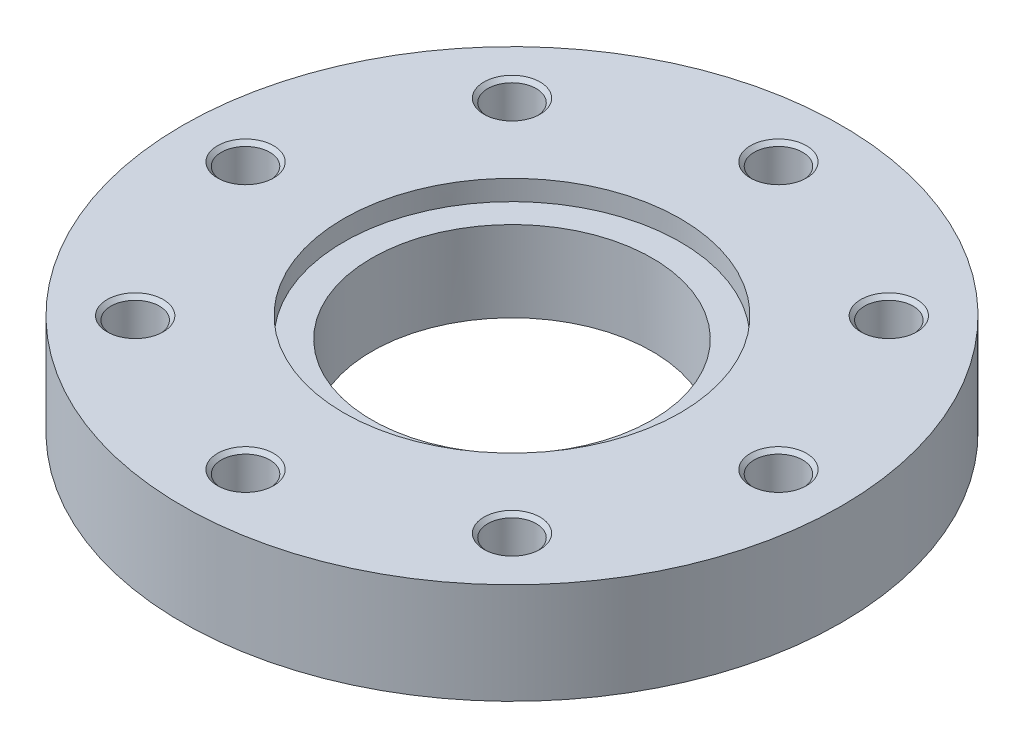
ISO-10303-21;
HEADER;
FILE_DESCRIPTION(('STEP AP214'),'2;1');
FILE_NAME('part.step','',(''),(''),'','','');
FILE_SCHEMA(('AUTOMOTIVE_DESIGN { 1 0 10303 214 1 1 1 1 }'));
ENDSEC;
DATA;
#1=APPLICATION_CONTEXT('core data for automotive mechanical design processes');
#2=APPLICATION_PROTOCOL_DEFINITION('international standard','automotive_design',2000,#1);
#3=PRODUCT_CONTEXT('',#1,'mechanical');
#4=PRODUCT('Part','Part','',(#3));
#5=PRODUCT_RELATED_PRODUCT_CATEGORY('part','',(#4));
#6=PRODUCT_DEFINITION_FORMATION('','',#4);
#7=PRODUCT_DEFINITION_CONTEXT('part definition',#1,'design');
#8=PRODUCT_DEFINITION('design','',#6,#7);
#9=PRODUCT_DEFINITION_SHAPE('','',#8);
#10=(LENGTH_UNIT() NAMED_UNIT(*) SI_UNIT(.MILLI.,.METRE.));
#11=(NAMED_UNIT(*) PLANE_ANGLE_UNIT() SI_UNIT($,.RADIAN.));
#12=(NAMED_UNIT(*) SI_UNIT($,.STERADIAN.) SOLID_ANGLE_UNIT());
#13=UNCERTAINTY_MEASURE_WITH_UNIT(LENGTH_MEASURE(1.E-05),#10,'distance_accuracy_value','');
#14=(GEOMETRIC_REPRESENTATION_CONTEXT(3) GLOBAL_UNCERTAINTY_ASSIGNED_CONTEXT((#13)) GLOBAL_UNIT_ASSIGNED_CONTEXT((#10,
#11,#12)) REPRESENTATION_CONTEXT('',''));
#15=CARTESIAN_POINT('',(0.,0.,0.));
#16=DIRECTION('',(0.,0.,1.));
#17=DIRECTION('',(1.,0.,0.));
#18=AXIS2_PLACEMENT_3D('',#15,#16,#17);
#19=CARTESIAN_POINT('',(0.,18.,0.));
#20=DIRECTION('',(0.,-1.,0.));
#21=DIRECTION('',(1.,0.,0.));
#22=AXIS2_PLACEMENT_3D('',#19,#20,#21);
#23=CYLINDRICAL_SURFACE('',#22,117.5);
#24=CARTESIAN_POINT('',(0.,0.,0.));
#25=DIRECTION('',(0.,1.,0.));
#26=DIRECTION('',(1.,0.,0.));
#27=AXIS2_PLACEMENT_3D('',#24,#25,#26);
#28=CIRCLE('',#27,117.5);
#29=CARTESIAN_POINT('',(117.5,0.,0.));
#30=VERTEX_POINT('',#29);
#31=EDGE_CURVE('E9',#30,#30,#28,.T.);
#32=ORIENTED_EDGE('',*,*,#31,.T.);
#33=EDGE_LOOP('',(#32));
#34=FACE_BOUND('',#33,.T.);
#35=CARTESIAN_POINT('',(0.,36.,0.));
#36=DIRECTION('',(0.,1.,0.));
#37=DIRECTION('',(1.,0.,0.));
#38=AXIS2_PLACEMENT_3D('',#35,#36,#37);
#39=CIRCLE('',#38,117.5);
#40=CARTESIAN_POINT('',(117.5,36.,0.));
#41=VERTEX_POINT('',#40);
#42=EDGE_CURVE('E317',#41,#41,#39,.T.);
#43=ORIENTED_EDGE('',*,*,#42,.F.);
#44=EDGE_LOOP('',(#43));
#45=FACE_BOUND('',#44,.T.);
#46=ADVANCED_FACE('F15',(#34,#45),#23,.T.);
#47=CARTESIAN_POINT('',(83.75,0.,0.));
#48=DIRECTION('',(0.,-1.,0.));
#49=DIRECTION('',(-1.,0.,0.));
#50=AXIS2_PLACEMENT_3D('',#47,#48,#49);
#51=PLANE('',#50);
#52=CARTESIAN_POINT('',(0.,0.,0.));
#53=DIRECTION('',(0.,1.,0.));
#54=DIRECTION('',(1.,0.,0.));
#55=AXIS2_PLACEMENT_3D('',#52,#53,#54);
#56=CIRCLE('',#55,50.);
#57=CARTESIAN_POINT('',(50.,0.,0.));
#58=VERTEX_POINT('',#57);
#59=EDGE_CURVE('E22',#58,#58,#56,.T.);
#60=ORIENTED_EDGE('',*,*,#59,.T.);
#61=EDGE_LOOP('',(#60));
#62=FACE_BOUND('',#61,.T.);
#63=ORIENTED_EDGE('',*,*,#31,.F.);
#64=EDGE_LOOP('',(#63));
#65=FACE_BOUND('',#64,.T.);
#66=ADVANCED_FACE('F323',(#62,#65),#51,.T.);
#67=CARTESIAN_POINT('',(0.,18.,0.));
#68=DIRECTION('',(0.,-1.,0.));
#69=DIRECTION('',(1.,0.,0.));
#70=AXIS2_PLACEMENT_3D('',#67,#68,#69);
#71=CYLINDRICAL_SURFACE('',#70,50.);
#72=ORIENTED_EDGE('',*,*,#59,.F.);
#73=EDGE_LOOP('',(#72));
#74=FACE_BOUND('',#73,.T.);
#75=CARTESIAN_POINT('',(0.,28.8,0.));
#76=DIRECTION('',(0.,1.,0.));
#77=DIRECTION('',(1.,0.,0.));
#78=AXIS2_PLACEMENT_3D('',#75,#76,#77);
#79=CIRCLE('',#78,50.);
#80=CARTESIAN_POINT('',(-50.,28.8,0.));
#81=VERTEX_POINT('',#80);
#82=EDGE_CURVE('E245',#81,#81,#79,.T.);
#83=ORIENTED_EDGE('',*,*,#82,.T.);
#84=EDGE_LOOP('',(#83));
#85=FACE_BOUND('',#84,.T.);
#86=ADVANCED_FACE('F328',(#74,#85),#71,.F.);
#87=CARTESIAN_POINT('',(83.75,36.,0.));
#88=DIRECTION('',(0.,1.,0.));
#89=DIRECTION('',(1.,0.,0.));
#90=AXIS2_PLACEMENT_3D('',#87,#88,#89);
#91=PLANE('',#90);
#92=ORIENTED_EDGE('',*,*,#42,.T.);
#93=EDGE_LOOP('',(#92));
#94=FACE_BOUND('',#93,.T.);
#95=CARTESIAN_POINT('',(0.,36.,0.));
#96=DIRECTION('',(0.,-1.,0.));
#97=DIRECTION('',(1.,0.,0.));
#98=AXIS2_PLACEMENT_3D('',#95,#96,#97);
#99=CIRCLE('',#98,60.);
#100=CARTESIAN_POINT('',(-60.,36.,0.));
#101=VERTEX_POINT('',#100);
#102=EDGE_CURVE('E246',#101,#101,#99,.T.);
#103=ORIENTED_EDGE('',*,*,#102,.T.);
#104=EDGE_LOOP('',(#103));
#105=FACE_BOUND('',#104,.T.);
#106=CARTESIAN_POINT('',(95.,36.,0.));
#107=DIRECTION('',(0.,-1.,0.));
#108=DIRECTION('',(1.,0.,0.));
#109=AXIS2_PLACEMENT_3D('',#106,#107,#108);
#110=CIRCLE('',#109,10.);
#111=CARTESIAN_POINT('',(105.,36.,0.));
#112=VERTEX_POINT('',#111);
#113=EDGE_CURVE('E307',#112,#112,#110,.T.);
#114=ORIENTED_EDGE('',*,*,#113,.T.);
#115=EDGE_LOOP('',(#114));
#116=FACE_BOUND('',#115,.T.);
#117=CARTESIAN_POINT('',(67.175144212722,36.,-67.175144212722));
#118=DIRECTION('',(0.,-1.,0.));
#119=DIRECTION('',(0.707106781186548,0.,-0.707106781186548));
#120=AXIS2_PLACEMENT_3D('',#117,#118,#119);
#121=CIRCLE('',#120,10.);
#122=CARTESIAN_POINT('',(74.2462120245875,36.,-74.2462120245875));
#123=VERTEX_POINT('',#122);
#124=EDGE_CURVE('E263',#123,#123,#121,.T.);
#125=ORIENTED_EDGE('',*,*,#124,.T.);
#126=EDGE_LOOP('',(#125));
#127=FACE_BOUND('',#126,.T.);
#128=CARTESIAN_POINT('',(0.,36.,-95.));
#129=DIRECTION('',(0.,-1.,0.));
#130=DIRECTION('',(0.,0.,-1.));
#131=AXIS2_PLACEMENT_3D('',#128,#129,#130);
#132=CIRCLE('',#131,10.);
#133=CARTESIAN_POINT('',(0.,36.,-105.));
#134=VERTEX_POINT('',#133);
#135=EDGE_CURVE('E289',#134,#134,#132,.T.);
#136=ORIENTED_EDGE('',*,*,#135,.T.);
#137=EDGE_LOOP('',(#136));
#138=FACE_BOUND('',#137,.T.);
#139=CARTESIAN_POINT('',(-67.175144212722,36.,-67.175144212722));
#140=DIRECTION('',(0.,-1.,0.));
#141=DIRECTION('',(-0.707106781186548,0.,-0.707106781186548));
#142=AXIS2_PLACEMENT_3D('',#139,#140,#141);
#143=CIRCLE('',#142,10.);
#144=CARTESIAN_POINT('',(-74.2462120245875,36.,-74.2462120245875));
#145=VERTEX_POINT('',#144);
#146=EDGE_CURVE('E277',#145,#145,#143,.T.);
#147=ORIENTED_EDGE('',*,*,#146,.T.);
#148=EDGE_LOOP('',(#147));
#149=FACE_BOUND('',#148,.T.);
#150=CARTESIAN_POINT('',(-95.,36.,0.));
#151=DIRECTION('',(0.,-1.,0.));
#152=DIRECTION('',(-1.,0.,0.));
#153=AXIS2_PLACEMENT_3D('',#150,#151,#152);
#154=CIRCLE('',#153,10.);
#155=CARTESIAN_POINT('',(-105.,36.,0.));
#156=VERTEX_POINT('',#155);
#157=EDGE_CURVE('E259',#156,#156,#154,.T.);
#158=ORIENTED_EDGE('',*,*,#157,.T.);
#159=EDGE_LOOP('',(#158));
#160=FACE_BOUND('',#159,.T.);
#161=CARTESIAN_POINT('',(-67.175144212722,36.,67.175144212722));
#162=DIRECTION('',(0.,-1.,0.));
#163=DIRECTION('',(-0.707106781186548,0.,0.707106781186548));
#164=AXIS2_PLACEMENT_3D('',#161,#162,#163);
#165=CIRCLE('',#164,10.);
#166=CARTESIAN_POINT('',(-74.2462120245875,36.,74.2462120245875));
#167=VERTEX_POINT('',#166);
#168=EDGE_CURVE('E232',#167,#167,#165,.T.);
#169=ORIENTED_EDGE('',*,*,#168,.T.);
#170=EDGE_LOOP('',(#169));
#171=FACE_BOUND('',#170,.T.);
#172=CARTESIAN_POINT('',(0.,36.,95.));
#173=DIRECTION('',(0.,-1.,0.));
#174=DIRECTION('',(0.,0.,1.));
#175=AXIS2_PLACEMENT_3D('',#172,#173,#174);
#176=CIRCLE('',#175,10.);
#177=CARTESIAN_POINT('',(0.,36.,105.));
#178=VERTEX_POINT('',#177);
#179=EDGE_CURVE('E211',#178,#178,#176,.T.);
#180=ORIENTED_EDGE('',*,*,#179,.T.);
#181=EDGE_LOOP('',(#180));
#182=FACE_BOUND('',#181,.T.);
#183=CARTESIAN_POINT('',(67.175144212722,36.,67.175144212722));
#184=DIRECTION('',(0.,-1.,0.));
#185=DIRECTION('',(0.707106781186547,0.,0.707106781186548));
#186=AXIS2_PLACEMENT_3D('',#183,#184,#185);
#187=CIRCLE('',#186,10.);
#188=CARTESIAN_POINT('',(74.2462120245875,36.,74.2462120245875));
#189=VERTEX_POINT('',#188);
#190=EDGE_CURVE('E229',#189,#189,#187,.T.);
#191=ORIENTED_EDGE('',*,*,#190,.T.);
#192=EDGE_LOOP('',(#191));
#193=FACE_BOUND('',#192,.T.);
#194=ADVANCED_FACE('F212',(#94,#105,#116,#127,#138,#149,#160,#171,#182,#193),#91,.T.);
#195=CARTESIAN_POINT('',(0.,28.8,0.));
#196=DIRECTION('',(0.,-1.,0.));
#197=DIRECTION('',(-1.,0.,0.));
#198=AXIS2_PLACEMENT_3D('',#195,#196,#197);
#199=PLANE('',#198);
#200=CARTESIAN_POINT('',(0.,28.8,0.));
#201=DIRECTION('',(0.,-1.,0.));
#202=DIRECTION('',(1.,0.,0.));
#203=AXIS2_PLACEMENT_3D('',#200,#201,#202);
#204=CIRCLE('',#203,60.);
#205=CARTESIAN_POINT('',(60.,28.8,0.));
#206=VERTEX_POINT('',#205);
#207=EDGE_CURVE('E243',#206,#206,#204,.T.);
#208=ORIENTED_EDGE('',*,*,#207,.F.);
#209=EDGE_LOOP('',(#208));
#210=FACE_BOUND('',#209,.T.);
#211=ORIENTED_EDGE('',*,*,#82,.F.);
#212=EDGE_LOOP('',(#211));
#213=FACE_BOUND('',#212,.T.);
#214=ADVANCED_FACE('F338',(#210,#213),#199,.F.);
#215=CARTESIAN_POINT('',(0.,34.2,0.));
#216=DIRECTION('',(0.,-1.,0.));
#217=DIRECTION('',(1.,0.,0.));
#218=AXIS2_PLACEMENT_3D('',#215,#216,#217);
#219=CYLINDRICAL_SURFACE('',#218,60.);
#220=ORIENTED_EDGE('',*,*,#207,.T.);
#221=EDGE_LOOP('',(#220));
#222=FACE_BOUND('',#221,.T.);
#223=ORIENTED_EDGE('',*,*,#102,.F.);
#224=EDGE_LOOP('',(#223));
#225=FACE_BOUND('',#224,.T.);
#226=ADVANCED_FACE('F341',(#222,#225),#219,.F.);
#227=CARTESIAN_POINT('',(95.,5.50386219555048,0.));
#228=DIRECTION('',(0.,1.,0.));
#229=DIRECTION('',(1.,0.,0.));
#230=AXIS2_PLACEMENT_3D('',#227,#228,#229);
#231=CONICAL_SURFACE('',#230,4.3234375,1.0471975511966);
#232=CARTESIAN_POINT('',(95.,8.,0.));
#233=DIRECTION('',(0.,-1.,0.));
#234=DIRECTION('',(1.,0.,0.));
#235=AXIS2_PLACEMENT_3D('',#232,#233,#234);
#236=CIRCLE('',#235,8.646875);
#237=CARTESIAN_POINT('',(103.646875,8.,0.));
#238=VERTEX_POINT('',#237);
#239=EDGE_CURVE('E313',#238,#238,#236,.T.);
#240=ORIENTED_EDGE('',*,*,#239,.F.);
#241=EDGE_LOOP('',(#240));
#242=FACE_BOUND('',#241,.T.);
#243=CARTESIAN_POINT('',(95.,3.00772439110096,0.));
#244=VERTEX_POINT('',#243);
#245=VERTEX_LOOP('',#244);
#246=FACE_BOUND('',#245,.T.);
#247=ADVANCED_FACE('F345',(#242,#246),#231,.F.);
#248=CARTESIAN_POINT('',(95.,11.3234375,0.));
#249=DIRECTION('',(0.,1.,0.));
#250=DIRECTION('',(1.,0.,0.));
#251=AXIS2_PLACEMENT_3D('',#248,#249,#250);
#252=CYLINDRICAL_SURFACE('',#251,8.646875);
#253=CARTESIAN_POINT('',(95.,14.646875,0.));
#254=DIRECTION('',(0.,-1.,0.));
#255=DIRECTION('',(1.,0.,0.));
#256=AXIS2_PLACEMENT_3D('',#253,#254,#255);
#257=CIRCLE('',#256,8.646875);
#258=CARTESIAN_POINT('',(103.646875,14.646875,0.));
#259=VERTEX_POINT('',#258);
#260=EDGE_CURVE('E311',#259,#259,#257,.T.);
#261=ORIENTED_EDGE('',*,*,#260,.F.);
#262=EDGE_LOOP('',(#261));
#263=FACE_BOUND('',#262,.T.);
#264=ORIENTED_EDGE('',*,*,#239,.T.);
#265=EDGE_LOOP('',(#264));
#266=FACE_BOUND('',#265,.T.);
#267=ADVANCED_FACE('F349',(#263,#266),#252,.F.);
#268=CARTESIAN_POINT('',(95.,15.3234375,0.));
#269=DIRECTION('',(0.,1.,0.));
#270=DIRECTION('',(1.,0.,0.));
#271=AXIS2_PLACEMENT_3D('',#268,#269,#270);
#272=CONICAL_SURFACE('',#271,9.3234375,0.785398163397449);
#273=CARTESIAN_POINT('',(95.,16.,0.));
#274=DIRECTION('',(0.,-1.,0.));
#275=DIRECTION('',(1.,0.,0.));
#276=AXIS2_PLACEMENT_3D('',#273,#274,#275);
#277=CIRCLE('',#276,10.);
#278=CARTESIAN_POINT('',(105.,16.,0.));
#279=VERTEX_POINT('',#278);
#280=EDGE_CURVE('E224',#279,#279,#277,.T.);
#281=ORIENTED_EDGE('',*,*,#280,.F.);
#282=EDGE_LOOP('',(#281));
#283=FACE_BOUND('',#282,.T.);
#284=ORIENTED_EDGE('',*,*,#260,.T.);
#285=EDGE_LOOP('',(#284));
#286=FACE_BOUND('',#285,.T.);
#287=ADVANCED_FACE('F353',(#283,#286),#272,.F.);
#288=CARTESIAN_POINT('',(104.3234375,16.,0.));
#289=DIRECTION('',(0.,1.,0.));
#290=DIRECTION('',(-1.,0.,0.));
#291=AXIS2_PLACEMENT_3D('',#288,#289,#290);
#292=PLANE('',#291);
#293=CARTESIAN_POINT('',(95.,16.,0.));
#294=DIRECTION('',(0.,-1.,0.));
#295=DIRECTION('',(1.,0.,0.));
#296=AXIS2_PLACEMENT_3D('',#293,#294,#295);
#297=CIRCLE('',#296,8.646875);
#298=CARTESIAN_POINT('',(103.646875,16.,0.));
#299=VERTEX_POINT('',#298);
#300=EDGE_CURVE('E309',#299,#299,#297,.T.);
#301=ORIENTED_EDGE('',*,*,#300,.F.);
#302=EDGE_LOOP('',(#301));
#303=FACE_BOUND('',#302,.T.);
#304=ORIENTED_EDGE('',*,*,#280,.T.);
#305=EDGE_LOOP('',(#304));
#306=FACE_BOUND('',#305,.T.);
#307=ADVANCED_FACE('F357',(#303,#306),#292,.F.);
#308=CARTESIAN_POINT('',(95.,25.3234375,0.));
#309=DIRECTION('',(0.,1.,0.));
#310=DIRECTION('',(1.,0.,0.));
#311=AXIS2_PLACEMENT_3D('',#308,#309,#310);
#312=CYLINDRICAL_SURFACE('',#311,8.646875);
#313=CARTESIAN_POINT('',(95.,34.646875,0.));
#314=DIRECTION('',(0.,-1.,0.));
#315=DIRECTION('',(1.,0.,0.));
#316=AXIS2_PLACEMENT_3D('',#313,#314,#315);
#317=CIRCLE('',#316,8.646875);
#318=CARTESIAN_POINT('',(103.646875,34.646875,0.));
#319=VERTEX_POINT('',#318);
#320=EDGE_CURVE('E305',#319,#319,#317,.T.);
#321=ORIENTED_EDGE('',*,*,#320,.F.);
#322=EDGE_LOOP('',(#321));
#323=FACE_BOUND('',#322,.T.);
#324=ORIENTED_EDGE('',*,*,#300,.T.);
#325=EDGE_LOOP('',(#324));
#326=FACE_BOUND('',#325,.T.);
#327=ADVANCED_FACE('F359',(#323,#326),#312,.F.);
#328=CARTESIAN_POINT('',(95.,35.3234375,0.));
#329=DIRECTION('',(0.,1.,0.));
#330=DIRECTION('',(1.,0.,0.));
#331=AXIS2_PLACEMENT_3D('',#328,#329,#330);
#332=CONICAL_SURFACE('',#331,9.3234375,0.785398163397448);
#333=ORIENTED_EDGE('',*,*,#113,.F.);
#334=EDGE_LOOP('',(#333));
#335=FACE_BOUND('',#334,.T.);
#336=ORIENTED_EDGE('',*,*,#320,.T.);
#337=EDGE_LOOP('',(#336));
#338=FACE_BOUND('',#337,.T.);
#339=ADVANCED_FACE('F362',(#335,#338),#332,.F.);
#340=CARTESIAN_POINT('',(67.175144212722,5.50386219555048,-67.175144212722));
#341=DIRECTION('',(0.,1.,0.));
#342=DIRECTION('',(0.707106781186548,0.,-0.707106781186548));
#343=AXIS2_PLACEMENT_3D('',#340,#341,#342);
#344=CONICAL_SURFACE('',#343,4.3234375,1.0471975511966);
#345=CARTESIAN_POINT('',(67.175144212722,8.,-67.175144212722));
#346=DIRECTION('',(0.,-1.,0.));
#347=DIRECTION('',(0.707106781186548,0.,-0.707106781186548));
#348=AXIS2_PLACEMENT_3D('',#345,#346,#347);
#349=CIRCLE('',#348,8.646875);
#350=CARTESIAN_POINT('',(73.2894081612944,8.,-73.2894081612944));
#351=VERTEX_POINT('',#350);
#352=EDGE_CURVE('E303',#351,#351,#349,.T.);
#353=ORIENTED_EDGE('',*,*,#352,.F.);
#354=EDGE_LOOP('',(#353));
#355=FACE_BOUND('',#354,.T.);
#356=CARTESIAN_POINT('',(67.175144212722,3.00772439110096,-67.175144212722));
#357=VERTEX_POINT('',#356);
#358=VERTEX_LOOP('',#357);
#359=FACE_BOUND('',#358,.T.);
#360=ADVANCED_FACE('F366',(#355,#359),#344,.F.);
#361=CARTESIAN_POINT('',(67.175144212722,11.3234375,-67.175144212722));
#362=DIRECTION('',(0.,1.,0.));
#363=DIRECTION('',(0.707106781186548,0.,-0.707106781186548));
#364=AXIS2_PLACEMENT_3D('',#361,#362,#363);
#365=CYLINDRICAL_SURFACE('',#364,8.646875);
#366=CARTESIAN_POINT('',(67.175144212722,14.646875,-67.175144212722));
#367=DIRECTION('',(0.,-1.,0.));
#368=DIRECTION('',(0.707106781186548,0.,-0.707106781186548));
#369=AXIS2_PLACEMENT_3D('',#366,#367,#368);
#370=CIRCLE('',#369,8.646875);
#371=CARTESIAN_POINT('',(73.2894081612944,14.646875,-73.2894081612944));
#372=VERTEX_POINT('',#371);
#373=EDGE_CURVE('E269',#372,#372,#370,.T.);
#374=ORIENTED_EDGE('',*,*,#373,.F.);
#375=EDGE_LOOP('',(#374));
#376=FACE_BOUND('',#375,.T.);
#377=ORIENTED_EDGE('',*,*,#352,.T.);
#378=EDGE_LOOP('',(#377));
#379=FACE_BOUND('',#378,.T.);
#380=ADVANCED_FACE('F370',(#376,#379),#365,.F.);
#381=CARTESIAN_POINT('',(67.175144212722,15.3234375,-67.175144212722));
#382=DIRECTION('',(0.,1.,0.));
#383=DIRECTION('',(0.707106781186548,0.,-0.707106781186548));
#384=AXIS2_PLACEMENT_3D('',#381,#382,#383);
#385=CONICAL_SURFACE('',#384,9.3234375,0.785398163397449);
#386=CARTESIAN_POINT('',(67.175144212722,16.,-67.175144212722));
#387=DIRECTION('',(0.,-1.,0.));
#388=DIRECTION('',(0.707106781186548,0.,-0.707106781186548));
#389=AXIS2_PLACEMENT_3D('',#386,#387,#388);
#390=CIRCLE('',#389,10.);
#391=CARTESIAN_POINT('',(74.2462120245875,16.,-74.2462120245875));
#392=VERTEX_POINT('',#391);
#393=EDGE_CURVE('E262',#392,#392,#390,.T.);
#394=ORIENTED_EDGE('',*,*,#393,.F.);
#395=EDGE_LOOP('',(#394));
#396=FACE_BOUND('',#395,.T.);
#397=ORIENTED_EDGE('',*,*,#373,.T.);
#398=EDGE_LOOP('',(#397));
#399=FACE_BOUND('',#398,.T.);
#400=ADVANCED_FACE('F372',(#396,#399),#385,.F.);
#401=CARTESIAN_POINT('',(73.767810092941,16.,-73.767810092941));
#402=DIRECTION('',(0.,1.,0.));
#403=DIRECTION('',(-0.707106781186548,0.,0.707106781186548));
#404=AXIS2_PLACEMENT_3D('',#401,#402,#403);
#405=PLANE('',#404);
#406=CARTESIAN_POINT('',(67.175144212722,16.,-67.175144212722));
#407=DIRECTION('',(0.,-1.,0.));
#408=DIRECTION('',(0.707106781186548,0.,-0.707106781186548));
#409=AXIS2_PLACEMENT_3D('',#406,#407,#408);
#410=CIRCLE('',#409,8.646875);
#411=CARTESIAN_POINT('',(73.2894081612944,16.,-73.2894081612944));
#412=VERTEX_POINT('',#411);
#413=EDGE_CURVE('E260',#412,#412,#410,.T.);
#414=ORIENTED_EDGE('',*,*,#413,.F.);
#415=EDGE_LOOP('',(#414));
#416=FACE_BOUND('',#415,.T.);
#417=ORIENTED_EDGE('',*,*,#393,.T.);
#418=EDGE_LOOP('',(#417));
#419=FACE_BOUND('',#418,.T.);
#420=ADVANCED_FACE('F375',(#416,#419),#405,.F.);
#421=CARTESIAN_POINT('',(67.175144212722,25.3234375,-67.175144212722));
#422=DIRECTION('',(0.,1.,0.));
#423=DIRECTION('',(0.707106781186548,0.,-0.707106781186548));
#424=AXIS2_PLACEMENT_3D('',#421,#422,#423);
#425=CYLINDRICAL_SURFACE('',#424,8.646875);
#426=CARTESIAN_POINT('',(67.175144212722,34.646875,-67.175144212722));
#427=DIRECTION('',(0.,-1.,0.));
#428=DIRECTION('',(0.707106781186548,0.,-0.707106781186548));
#429=AXIS2_PLACEMENT_3D('',#426,#427,#428);
#430=CIRCLE('',#429,8.646875);
#431=CARTESIAN_POINT('',(73.2894081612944,34.646875,-73.2894081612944));
#432=VERTEX_POINT('',#431);
#433=EDGE_CURVE('E299',#432,#432,#430,.T.);
#434=ORIENTED_EDGE('',*,*,#433,.F.);
#435=EDGE_LOOP('',(#434));
#436=FACE_BOUND('',#435,.T.);
#437=ORIENTED_EDGE('',*,*,#413,.T.);
#438=EDGE_LOOP('',(#437));
#439=FACE_BOUND('',#438,.T.);
#440=ADVANCED_FACE('F379',(#436,#439),#425,.F.);
#441=CARTESIAN_POINT('',(67.175144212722,35.3234375,-67.175144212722));
#442=DIRECTION('',(0.,1.,0.));
#443=DIRECTION('',(0.707106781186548,0.,-0.707106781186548));
#444=AXIS2_PLACEMENT_3D('',#441,#442,#443);
#445=CONICAL_SURFACE('',#444,9.3234375,0.785398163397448);
#446=ORIENTED_EDGE('',*,*,#124,.F.);
#447=EDGE_LOOP('',(#446));
#448=FACE_BOUND('',#447,.T.);
#449=ORIENTED_EDGE('',*,*,#433,.T.);
#450=EDGE_LOOP('',(#449));
#451=FACE_BOUND('',#450,.T.);
#452=ADVANCED_FACE('F383',(#448,#451),#445,.F.);
#453=CARTESIAN_POINT('',(0.,5.50386219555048,-95.));
#454=DIRECTION('',(0.,1.,0.));
#455=DIRECTION('',(0.,0.,-1.));
#456=AXIS2_PLACEMENT_3D('',#453,#454,#455);
#457=CONICAL_SURFACE('',#456,4.3234375,1.0471975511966);
#458=CARTESIAN_POINT('',(0.,8.,-95.));
#459=DIRECTION('',(0.,-1.,0.));
#460=DIRECTION('',(0.,0.,-1.));
#461=AXIS2_PLACEMENT_3D('',#458,#459,#460);
#462=CIRCLE('',#461,8.646875);
#463=CARTESIAN_POINT('',(0.,8.,-103.646875));
#464=VERTEX_POINT('',#463);
#465=EDGE_CURVE('E297',#464,#464,#462,.T.);
#466=ORIENTED_EDGE('',*,*,#465,.F.);
#467=EDGE_LOOP('',(#466));
#468=FACE_BOUND('',#467,.T.);
#469=CARTESIAN_POINT('',(0.,3.00772439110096,-95.));
#470=VERTEX_POINT('',#469);
#471=VERTEX_LOOP('',#470);
#472=FACE_BOUND('',#471,.T.);
#473=ADVANCED_FACE('F387',(#468,#472),#457,.F.);
#474=CARTESIAN_POINT('',(0.,11.3234375,-95.));
#475=DIRECTION('',(0.,1.,0.));
#476=DIRECTION('',(0.,0.,-1.));
#477=AXIS2_PLACEMENT_3D('',#474,#475,#476);
#478=CYLINDRICAL_SURFACE('',#477,8.646875);
#479=CARTESIAN_POINT('',(0.,14.646875,-95.));
#480=DIRECTION('',(0.,-1.,0.));
#481=DIRECTION('',(0.,0.,-1.));
#482=AXIS2_PLACEMENT_3D('',#479,#480,#481);
#483=CIRCLE('',#482,8.646875);
#484=CARTESIAN_POINT('',(0.,14.646875,-103.646875));
#485=VERTEX_POINT('',#484);
#486=EDGE_CURVE('E295',#485,#485,#483,.T.);
#487=ORIENTED_EDGE('',*,*,#486,.F.);
#488=EDGE_LOOP('',(#487));
#489=FACE_BOUND('',#488,.T.);
#490=ORIENTED_EDGE('',*,*,#465,.T.);
#491=EDGE_LOOP('',(#490));
#492=FACE_BOUND('',#491,.T.);
#493=ADVANCED_FACE('F391',(#489,#492),#478,.F.);
#494=CARTESIAN_POINT('',(0.,15.3234375,-95.));
#495=DIRECTION('',(0.,1.,0.));
#496=DIRECTION('',(0.,0.,-1.));
#497=AXIS2_PLACEMENT_3D('',#494,#495,#496);
#498=CONICAL_SURFACE('',#497,9.3234375,0.785398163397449);
#499=CARTESIAN_POINT('',(0.,16.,-95.));
#500=DIRECTION('',(0.,-1.,0.));
#501=DIRECTION('',(0.,0.,-1.));
#502=AXIS2_PLACEMENT_3D('',#499,#500,#501);
#503=CIRCLE('',#502,10.);
#504=CARTESIAN_POINT('',(0.,16.,-105.));
#505=VERTEX_POINT('',#504);
#506=EDGE_CURVE('E293',#505,#505,#503,.T.);
#507=ORIENTED_EDGE('',*,*,#506,.F.);
#508=EDGE_LOOP('',(#507));
#509=FACE_BOUND('',#508,.T.);
#510=ORIENTED_EDGE('',*,*,#486,.T.);
#511=EDGE_LOOP('',(#510));
#512=FACE_BOUND('',#511,.T.);
#513=ADVANCED_FACE('F395',(#509,#512),#498,.F.);
#514=CARTESIAN_POINT('',(0.,16.,-104.3234375));
#515=DIRECTION('',(0.,1.,0.));
#516=DIRECTION('',(0.,0.,1.));
#517=AXIS2_PLACEMENT_3D('',#514,#515,#516);
#518=PLANE('',#517);
#519=CARTESIAN_POINT('',(0.,16.,-95.));
#520=DIRECTION('',(0.,-1.,0.));
#521=DIRECTION('',(0.,0.,-1.));
#522=AXIS2_PLACEMENT_3D('',#519,#520,#521);
#523=CIRCLE('',#522,8.646875);
#524=CARTESIAN_POINT('',(0.,16.,-103.646875));
#525=VERTEX_POINT('',#524);
#526=EDGE_CURVE('E291',#525,#525,#523,.T.);
#527=ORIENTED_EDGE('',*,*,#526,.F.);
#528=EDGE_LOOP('',(#527));
#529=FACE_BOUND('',#528,.T.);
#530=ORIENTED_EDGE('',*,*,#506,.T.);
#531=EDGE_LOOP('',(#530));
#532=FACE_BOUND('',#531,.T.);
#533=ADVANCED_FACE('F399',(#529,#532),#518,.F.);
#534=CARTESIAN_POINT('',(0.,25.3234375,-95.));
#535=DIRECTION('',(0.,1.,0.));
#536=DIRECTION('',(0.,0.,-1.));
#537=AXIS2_PLACEMENT_3D('',#534,#535,#536);
#538=CYLINDRICAL_SURFACE('',#537,8.646875);
#539=CARTESIAN_POINT('',(0.,34.646875,-95.));
#540=DIRECTION('',(0.,-1.,0.));
#541=DIRECTION('',(0.,0.,-1.));
#542=AXIS2_PLACEMENT_3D('',#539,#540,#541);
#543=CIRCLE('',#542,8.646875);
#544=CARTESIAN_POINT('',(0.,34.646875,-103.646875));
#545=VERTEX_POINT('',#544);
#546=EDGE_CURVE('E287',#545,#545,#543,.T.);
#547=ORIENTED_EDGE('',*,*,#546,.F.);
#548=EDGE_LOOP('',(#547));
#549=FACE_BOUND('',#548,.T.);
#550=ORIENTED_EDGE('',*,*,#526,.T.);
#551=EDGE_LOOP('',(#550));
#552=FACE_BOUND('',#551,.T.);
#553=ADVANCED_FACE('F403',(#549,#552),#538,.F.);
#554=CARTESIAN_POINT('',(0.,35.3234375,-95.));
#555=DIRECTION('',(0.,1.,0.));
#556=DIRECTION('',(0.,0.,-1.));
#557=AXIS2_PLACEMENT_3D('',#554,#555,#556);
#558=CONICAL_SURFACE('',#557,9.3234375,0.785398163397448);
#559=ORIENTED_EDGE('',*,*,#135,.F.);
#560=EDGE_LOOP('',(#559));
#561=FACE_BOUND('',#560,.T.);
#562=ORIENTED_EDGE('',*,*,#546,.T.);
#563=EDGE_LOOP('',(#562));
#564=FACE_BOUND('',#563,.T.);
#565=ADVANCED_FACE('F407',(#561,#564),#558,.F.);
#566=CARTESIAN_POINT('',(-67.175144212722,5.50386219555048,-67.175144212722));
#567=DIRECTION('',(0.,1.,0.));
#568=DIRECTION('',(-0.707106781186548,0.,-0.707106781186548));
#569=AXIS2_PLACEMENT_3D('',#566,#567,#568);
#570=CONICAL_SURFACE('',#569,4.3234375,1.0471975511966);
#571=CARTESIAN_POINT('',(-67.175144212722,8.,-67.175144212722));
#572=DIRECTION('',(0.,-1.,0.));
#573=DIRECTION('',(-0.707106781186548,0.,-0.707106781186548));
#574=AXIS2_PLACEMENT_3D('',#571,#572,#573);
#575=CIRCLE('',#574,8.646875);
#576=CARTESIAN_POINT('',(-73.2894081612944,8.,-73.2894081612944));
#577=VERTEX_POINT('',#576);
#578=EDGE_CURVE('E285',#577,#577,#575,.T.);
#579=ORIENTED_EDGE('',*,*,#578,.F.);
#580=EDGE_LOOP('',(#579));
#581=FACE_BOUND('',#580,.T.);
#582=CARTESIAN_POINT('',(-67.175144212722,3.00772439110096,-67.175144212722));
#583=VERTEX_POINT('',#582);
#584=VERTEX_LOOP('',#583);
#585=FACE_BOUND('',#584,.T.);
#586=ADVANCED_FACE('F411',(#581,#585),#570,.F.);
#587=CARTESIAN_POINT('',(-67.175144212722,11.3234375,-67.175144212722));
#588=DIRECTION('',(0.,1.,0.));
#589=DIRECTION('',(-0.707106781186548,0.,-0.707106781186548));
#590=AXIS2_PLACEMENT_3D('',#587,#588,#589);
#591=CYLINDRICAL_SURFACE('',#590,8.646875);
#592=CARTESIAN_POINT('',(-67.175144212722,14.646875,-67.175144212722));
#593=DIRECTION('',(0.,-1.,0.));
#594=DIRECTION('',(-0.707106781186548,0.,-0.707106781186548));
#595=AXIS2_PLACEMENT_3D('',#592,#593,#594);
#596=CIRCLE('',#595,8.646875);
#597=CARTESIAN_POINT('',(-73.2894081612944,14.646875,-73.2894081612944));
#598=VERTEX_POINT('',#597);
#599=EDGE_CURVE('E283',#598,#598,#596,.T.);
#600=ORIENTED_EDGE('',*,*,#599,.F.);
#601=EDGE_LOOP('',(#600));
#602=FACE_BOUND('',#601,.T.);
#603=ORIENTED_EDGE('',*,*,#578,.T.);
#604=EDGE_LOOP('',(#603));
#605=FACE_BOUND('',#604,.T.);
#606=ADVANCED_FACE('F415',(#602,#605),#591,.F.);
#607=CARTESIAN_POINT('',(-67.175144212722,15.3234375,-67.175144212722));
#608=DIRECTION('',(0.,1.,0.));
#609=DIRECTION('',(-0.707106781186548,0.,-0.707106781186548));
#610=AXIS2_PLACEMENT_3D('',#607,#608,#609);
#611=CONICAL_SURFACE('',#610,9.3234375,0.785398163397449);
#612=CARTESIAN_POINT('',(-67.175144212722,16.,-67.175144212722));
#613=DIRECTION('',(0.,-1.,0.));
#614=DIRECTION('',(-0.707106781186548,0.,-0.707106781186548));
#615=AXIS2_PLACEMENT_3D('',#612,#613,#614);
#616=CIRCLE('',#615,10.);
#617=CARTESIAN_POINT('',(-74.2462120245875,16.,-74.2462120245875));
#618=VERTEX_POINT('',#617);
#619=EDGE_CURVE('E281',#618,#618,#616,.T.);
#620=ORIENTED_EDGE('',*,*,#619,.F.);
#621=EDGE_LOOP('',(#620));
#622=FACE_BOUND('',#621,.T.);
#623=ORIENTED_EDGE('',*,*,#599,.T.);
#624=EDGE_LOOP('',(#623));
#625=FACE_BOUND('',#624,.T.);
#626=ADVANCED_FACE('F419',(#622,#625),#611,.F.);
#627=CARTESIAN_POINT('',(-73.767810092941,16.,-73.767810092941));
#628=DIRECTION('',(0.,1.,0.));
#629=DIRECTION('',(0.707106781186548,0.,0.707106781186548));
#630=AXIS2_PLACEMENT_3D('',#627,#628,#629);
#631=PLANE('',#630);
#632=CARTESIAN_POINT('',(-67.175144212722,16.,-67.175144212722));
#633=DIRECTION('',(0.,-1.,0.));
#634=DIRECTION('',(-0.707106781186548,0.,-0.707106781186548));
#635=AXIS2_PLACEMENT_3D('',#632,#633,#634);
#636=CIRCLE('',#635,8.646875);
#637=CARTESIAN_POINT('',(-73.2894081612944,16.,-73.2894081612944));
#638=VERTEX_POINT('',#637);
#639=EDGE_CURVE('E279',#638,#638,#636,.T.);
#640=ORIENTED_EDGE('',*,*,#639,.F.);
#641=EDGE_LOOP('',(#640));
#642=FACE_BOUND('',#641,.T.);
#643=ORIENTED_EDGE('',*,*,#619,.T.);
#644=EDGE_LOOP('',(#643));
#645=FACE_BOUND('',#644,.T.);
#646=ADVANCED_FACE('F423',(#642,#645),#631,.F.);
#647=CARTESIAN_POINT('',(-67.175144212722,25.3234375,-67.175144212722));
#648=DIRECTION('',(0.,1.,0.));
#649=DIRECTION('',(-0.707106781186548,0.,-0.707106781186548));
#650=AXIS2_PLACEMENT_3D('',#647,#648,#649);
#651=CYLINDRICAL_SURFACE('',#650,8.646875);
#652=CARTESIAN_POINT('',(-67.175144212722,34.646875,-67.175144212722));
#653=DIRECTION('',(0.,-1.,0.));
#654=DIRECTION('',(-0.707106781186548,0.,-0.707106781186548));
#655=AXIS2_PLACEMENT_3D('',#652,#653,#654);
#656=CIRCLE('',#655,8.646875);
#657=CARTESIAN_POINT('',(-73.2894081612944,34.646875,-73.2894081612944));
#658=VERTEX_POINT('',#657);
#659=EDGE_CURVE('E275',#658,#658,#656,.T.);
#660=ORIENTED_EDGE('',*,*,#659,.F.);
#661=EDGE_LOOP('',(#660));
#662=FACE_BOUND('',#661,.T.);
#663=ORIENTED_EDGE('',*,*,#639,.T.);
#664=EDGE_LOOP('',(#663));
#665=FACE_BOUND('',#664,.T.);
#666=ADVANCED_FACE('F427',(#662,#665),#651,.F.);
#667=CARTESIAN_POINT('',(-67.175144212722,35.3234375,-67.175144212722));
#668=DIRECTION('',(0.,1.,0.));
#669=DIRECTION('',(-0.707106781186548,0.,-0.707106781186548));
#670=AXIS2_PLACEMENT_3D('',#667,#668,#669);
#671=CONICAL_SURFACE('',#670,9.3234375,0.785398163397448);
#672=ORIENTED_EDGE('',*,*,#146,.F.);
#673=EDGE_LOOP('',(#672));
#674=FACE_BOUND('',#673,.T.);
#675=ORIENTED_EDGE('',*,*,#659,.T.);
#676=EDGE_LOOP('',(#675));
#677=FACE_BOUND('',#676,.T.);
#678=ADVANCED_FACE('F434',(#674,#677),#671,.F.);
#679=CARTESIAN_POINT('',(-95.,5.50386219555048,0.));
#680=DIRECTION('',(0.,1.,0.));
#681=DIRECTION('',(-1.,0.,0.));
#682=AXIS2_PLACEMENT_3D('',#679,#680,#681);
#683=CONICAL_SURFACE('',#682,4.3234375,1.0471975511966);
#684=CARTESIAN_POINT('',(-95.,8.,0.));
#685=DIRECTION('',(0.,-1.,0.));
#686=DIRECTION('',(-1.,0.,0.));
#687=AXIS2_PLACEMENT_3D('',#684,#685,#686);
#688=CIRCLE('',#687,8.646875);
#689=CARTESIAN_POINT('',(-103.646875,8.,0.));
#690=VERTEX_POINT('',#689);
#691=EDGE_CURVE('E273',#690,#690,#688,.T.);
#692=ORIENTED_EDGE('',*,*,#691,.F.);
#693=EDGE_LOOP('',(#692));
#694=FACE_BOUND('',#693,.T.);
#695=CARTESIAN_POINT('',(-95.,3.00772439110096,0.));
#696=VERTEX_POINT('',#695);
#697=VERTEX_LOOP('',#696);
#698=FACE_BOUND('',#697,.T.);
#699=ADVANCED_FACE('F438',(#694,#698),#683,.F.);
#700=CARTESIAN_POINT('',(-95.,11.3234375,0.));
#701=DIRECTION('',(0.,1.,0.));
#702=DIRECTION('',(-1.,0.,0.));
#703=AXIS2_PLACEMENT_3D('',#700,#701,#702);
#704=CYLINDRICAL_SURFACE('',#703,8.646875);
#705=CARTESIAN_POINT('',(-95.,14.646875,0.));
#706=DIRECTION('',(0.,-1.,0.));
#707=DIRECTION('',(-1.,0.,0.));
#708=AXIS2_PLACEMENT_3D('',#705,#706,#707);
#709=CIRCLE('',#708,8.646875);
#710=CARTESIAN_POINT('',(-103.646875,14.646875,0.));
#711=VERTEX_POINT('',#710);
#712=EDGE_CURVE('E271',#711,#711,#709,.T.);
#713=ORIENTED_EDGE('',*,*,#712,.F.);
#714=EDGE_LOOP('',(#713));
#715=FACE_BOUND('',#714,.T.);
#716=ORIENTED_EDGE('',*,*,#691,.T.);
#717=EDGE_LOOP('',(#716));
#718=FACE_BOUND('',#717,.T.);
#719=ADVANCED_FACE('F442',(#715,#718),#704,.F.);
#720=CARTESIAN_POINT('',(-95.,15.3234375,0.));
#721=DIRECTION('',(0.,1.,0.));
#722=DIRECTION('',(-1.,0.,0.));
#723=AXIS2_PLACEMENT_3D('',#720,#721,#722);
#724=CONICAL_SURFACE('',#723,9.3234375,0.785398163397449);
#725=CARTESIAN_POINT('',(-95.,16.,0.));
#726=DIRECTION('',(0.,-1.,0.));
#727=DIRECTION('',(-1.,0.,0.));
#728=AXIS2_PLACEMENT_3D('',#725,#726,#727);
#729=CIRCLE('',#728,10.);
#730=CARTESIAN_POINT('',(-105.,16.,0.));
#731=VERTEX_POINT('',#730);
#732=EDGE_CURVE('E267',#731,#731,#729,.T.);
#733=ORIENTED_EDGE('',*,*,#732,.F.);
#734=EDGE_LOOP('',(#733));
#735=FACE_BOUND('',#734,.T.);
#736=ORIENTED_EDGE('',*,*,#712,.T.);
#737=EDGE_LOOP('',(#736));
#738=FACE_BOUND('',#737,.T.);
#739=ADVANCED_FACE('F446',(#735,#738),#724,.F.);
#740=CARTESIAN_POINT('',(-104.3234375,16.,0.));
#741=DIRECTION('',(0.,1.,0.));
#742=DIRECTION('',(1.,0.,0.));
#743=AXIS2_PLACEMENT_3D('',#740,#741,#742);
#744=PLANE('',#743);
#745=CARTESIAN_POINT('',(-95.,16.,0.));
#746=DIRECTION('',(0.,-1.,0.));
#747=DIRECTION('',(-1.,0.,0.));
#748=AXIS2_PLACEMENT_3D('',#745,#746,#747);
#749=CIRCLE('',#748,8.646875);
#750=CARTESIAN_POINT('',(-103.646875,16.,0.));
#751=VERTEX_POINT('',#750);
#752=EDGE_CURVE('E265',#751,#751,#749,.T.);
#753=ORIENTED_EDGE('',*,*,#752,.F.);
#754=EDGE_LOOP('',(#753));
#755=FACE_BOUND('',#754,.T.);
#756=ORIENTED_EDGE('',*,*,#732,.T.);
#757=EDGE_LOOP('',(#756));
#758=FACE_BOUND('',#757,.T.);
#759=ADVANCED_FACE('F450',(#755,#758),#744,.F.);
#760=CARTESIAN_POINT('',(-95.,25.3234375,0.));
#761=DIRECTION('',(0.,1.,0.));
#762=DIRECTION('',(-1.,0.,0.));
#763=AXIS2_PLACEMENT_3D('',#760,#761,#762);
#764=CYLINDRICAL_SURFACE('',#763,8.646875);
#765=CARTESIAN_POINT('',(-95.,34.646875,0.));
#766=DIRECTION('',(0.,-1.,0.));
#767=DIRECTION('',(-1.,0.,0.));
#768=AXIS2_PLACEMENT_3D('',#765,#766,#767);
#769=CIRCLE('',#768,8.646875);
#770=CARTESIAN_POINT('',(-103.646875,34.646875,0.));
#771=VERTEX_POINT('',#770);
#772=EDGE_CURVE('E257',#771,#771,#769,.T.);
#773=ORIENTED_EDGE('',*,*,#772,.F.);
#774=EDGE_LOOP('',(#773));
#775=FACE_BOUND('',#774,.T.);
#776=ORIENTED_EDGE('',*,*,#752,.T.);
#777=EDGE_LOOP('',(#776));
#778=FACE_BOUND('',#777,.T.);
#779=ADVANCED_FACE('F454',(#775,#778),#764,.F.);
#780=CARTESIAN_POINT('',(-95.,35.3234375,0.));
#781=DIRECTION('',(0.,1.,0.));
#782=DIRECTION('',(-1.,0.,0.));
#783=AXIS2_PLACEMENT_3D('',#780,#781,#782);
#784=CONICAL_SURFACE('',#783,9.3234375,0.785398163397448);
#785=ORIENTED_EDGE('',*,*,#157,.F.);
#786=EDGE_LOOP('',(#785));
#787=FACE_BOUND('',#786,.T.);
#788=ORIENTED_EDGE('',*,*,#772,.T.);
#789=EDGE_LOOP('',(#788));
#790=FACE_BOUND('',#789,.T.);
#791=ADVANCED_FACE('F461',(#787,#790),#784,.F.);
#792=CARTESIAN_POINT('',(-67.175144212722,5.50386219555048,67.175144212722));
#793=DIRECTION('',(0.,1.,0.));
#794=DIRECTION('',(-0.707106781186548,0.,0.707106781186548));
#795=AXIS2_PLACEMENT_3D('',#792,#793,#794);
#796=CONICAL_SURFACE('',#795,4.3234375,1.0471975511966);
#797=CARTESIAN_POINT('',(-67.175144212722,8.,67.175144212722));
#798=DIRECTION('',(0.,-1.,0.));
#799=DIRECTION('',(-0.707106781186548,0.,0.707106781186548));
#800=AXIS2_PLACEMENT_3D('',#797,#798,#799);
#801=CIRCLE('',#800,8.646875);
#802=CARTESIAN_POINT('',(-73.2894081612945,8.,73.2894081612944));
#803=VERTEX_POINT('',#802);
#804=EDGE_CURVE('E255',#803,#803,#801,.T.);
#805=ORIENTED_EDGE('',*,*,#804,.F.);
#806=EDGE_LOOP('',(#805));
#807=FACE_BOUND('',#806,.T.);
#808=CARTESIAN_POINT('',(-67.175144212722,3.00772439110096,67.175144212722));
#809=VERTEX_POINT('',#808);
#810=VERTEX_LOOP('',#809);
#811=FACE_BOUND('',#810,.T.);
#812=ADVANCED_FACE('F465',(#807,#811),#796,.F.);
#813=CARTESIAN_POINT('',(-67.175144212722,11.3234375,67.175144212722));
#814=DIRECTION('',(0.,1.,0.));
#815=DIRECTION('',(-0.707106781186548,0.,0.707106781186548));
#816=AXIS2_PLACEMENT_3D('',#813,#814,#815);
#817=CYLINDRICAL_SURFACE('',#816,8.646875);
#818=CARTESIAN_POINT('',(-67.175144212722,14.646875,67.175144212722));
#819=DIRECTION('',(0.,-1.,0.));
#820=DIRECTION('',(-0.707106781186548,0.,0.707106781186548));
#821=AXIS2_PLACEMENT_3D('',#818,#819,#820);
#822=CIRCLE('',#821,8.646875);
#823=CARTESIAN_POINT('',(-73.2894081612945,14.646875,73.2894081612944));
#824=VERTEX_POINT('',#823);
#825=EDGE_CURVE('E253',#824,#824,#822,.T.);
#826=ORIENTED_EDGE('',*,*,#825,.F.);
#827=EDGE_LOOP('',(#826));
#828=FACE_BOUND('',#827,.T.);
#829=ORIENTED_EDGE('',*,*,#804,.T.);
#830=EDGE_LOOP('',(#829));
#831=FACE_BOUND('',#830,.T.);
#832=ADVANCED_FACE('F469',(#828,#831),#817,.F.);
#833=CARTESIAN_POINT('',(-67.175144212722,15.3234375,67.175144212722));
#834=DIRECTION('',(0.,1.,0.));
#835=DIRECTION('',(-0.707106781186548,0.,0.707106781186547));
#836=AXIS2_PLACEMENT_3D('',#833,#834,#835);
#837=CONICAL_SURFACE('',#836,9.3234375,0.785398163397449);
#838=CARTESIAN_POINT('',(-67.175144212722,16.,67.175144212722));
#839=DIRECTION('',(0.,-1.,0.));
#840=DIRECTION('',(-0.707106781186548,0.,0.707106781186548));
#841=AXIS2_PLACEMENT_3D('',#838,#839,#840);
#842=CIRCLE('',#841,10.);
#843=CARTESIAN_POINT('',(-74.2462120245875,16.,74.2462120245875));
#844=VERTEX_POINT('',#843);
#845=EDGE_CURVE('E251',#844,#844,#842,.T.);
#846=ORIENTED_EDGE('',*,*,#845,.F.);
#847=EDGE_LOOP('',(#846));
#848=FACE_BOUND('',#847,.T.);
#849=ORIENTED_EDGE('',*,*,#825,.T.);
#850=EDGE_LOOP('',(#849));
#851=FACE_BOUND('',#850,.T.);
#852=ADVANCED_FACE('F473',(#848,#851),#837,.F.);
#853=CARTESIAN_POINT('',(-73.767810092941,16.,73.767810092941));
#854=DIRECTION('',(0.,1.,0.));
#855=DIRECTION('',(0.707106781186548,0.,-0.707106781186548));
#856=AXIS2_PLACEMENT_3D('',#853,#854,#855);
#857=PLANE('',#856);
#858=CARTESIAN_POINT('',(-67.175144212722,16.,67.175144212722));
#859=DIRECTION('',(0.,-1.,0.));
#860=DIRECTION('',(-0.707106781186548,0.,0.707106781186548));
#861=AXIS2_PLACEMENT_3D('',#858,#859,#860);
#862=CIRCLE('',#861,8.646875);
#863=CARTESIAN_POINT('',(-73.2894081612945,16.,73.2894081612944));
#864=VERTEX_POINT('',#863);
#865=EDGE_CURVE('E234',#864,#864,#862,.T.);
#866=ORIENTED_EDGE('',*,*,#865,.F.);
#867=EDGE_LOOP('',(#866));
#868=FACE_BOUND('',#867,.T.);
#869=ORIENTED_EDGE('',*,*,#845,.T.);
#870=EDGE_LOOP('',(#869));
#871=FACE_BOUND('',#870,.T.);
#872=ADVANCED_FACE('F475',(#868,#871),#857,.F.);
#873=CARTESIAN_POINT('',(-67.175144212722,25.3234375,67.175144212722));
#874=DIRECTION('',(0.,1.,0.));
#875=DIRECTION('',(-0.707106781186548,0.,0.707106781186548));
#876=AXIS2_PLACEMENT_3D('',#873,#874,#875);
#877=CYLINDRICAL_SURFACE('',#876,8.646875);
#878=CARTESIAN_POINT('',(-67.175144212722,34.646875,67.175144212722));
#879=DIRECTION('',(0.,-1.,0.));
#880=DIRECTION('',(-0.707106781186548,0.,0.707106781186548));
#881=AXIS2_PLACEMENT_3D('',#878,#879,#880);
#882=CIRCLE('',#881,8.646875);
#883=CARTESIAN_POINT('',(-73.2894081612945,34.646875,73.2894081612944));
#884=VERTEX_POINT('',#883);
#885=EDGE_CURVE('E235',#884,#884,#882,.T.);
#886=ORIENTED_EDGE('',*,*,#885,.F.);
#887=EDGE_LOOP('',(#886));
#888=FACE_BOUND('',#887,.T.);
#889=ORIENTED_EDGE('',*,*,#865,.T.);
#890=EDGE_LOOP('',(#889));
#891=FACE_BOUND('',#890,.T.);
#892=ADVANCED_FACE('F478',(#888,#891),#877,.F.);
#893=CARTESIAN_POINT('',(-67.175144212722,35.3234375,67.175144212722));
#894=DIRECTION('',(0.,1.,0.));
#895=DIRECTION('',(-0.707106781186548,0.,0.707106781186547));
#896=AXIS2_PLACEMENT_3D('',#893,#894,#895);
#897=CONICAL_SURFACE('',#896,9.3234375,0.785398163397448);
#898=ORIENTED_EDGE('',*,*,#168,.F.);
#899=EDGE_LOOP('',(#898));
#900=FACE_BOUND('',#899,.T.);
#901=ORIENTED_EDGE('',*,*,#885,.T.);
#902=EDGE_LOOP('',(#901));
#903=FACE_BOUND('',#902,.T.);
#904=ADVANCED_FACE('F482',(#900,#903),#897,.F.);
#905=CARTESIAN_POINT('',(0.,5.50386219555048,95.));
#906=DIRECTION('',(0.,1.,0.));
#907=DIRECTION('',(0.,0.,1.));
#908=AXIS2_PLACEMENT_3D('',#905,#906,#907);
#909=CONICAL_SURFACE('',#908,4.3234375,1.0471975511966);
#910=CARTESIAN_POINT('',(0.,8.,95.));
#911=DIRECTION('',(0.,-1.,0.));
#912=DIRECTION('',(0.,0.,1.));
#913=AXIS2_PLACEMENT_3D('',#910,#911,#912);
#914=CIRCLE('',#913,8.646875);
#915=CARTESIAN_POINT('',(0.,8.,103.646875));
#916=VERTEX_POINT('',#915);
#917=EDGE_CURVE('E236',#916,#916,#914,.T.);
#918=ORIENTED_EDGE('',*,*,#917,.F.);
#919=EDGE_LOOP('',(#918));
#920=FACE_BOUND('',#919,.T.);
#921=CARTESIAN_POINT('',(0.,3.00772439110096,95.));
#922=VERTEX_POINT('',#921);
#923=VERTEX_LOOP('',#922);
#924=FACE_BOUND('',#923,.T.);
#925=ADVANCED_FACE('F500',(#920,#924),#909,.F.);
#926=CARTESIAN_POINT('',(0.,11.3234375,95.));
#927=DIRECTION('',(0.,1.,0.));
#928=DIRECTION('',(0.,0.,1.));
#929=AXIS2_PLACEMENT_3D('',#926,#927,#928);
#930=CYLINDRICAL_SURFACE('',#929,8.646875);
#931=CARTESIAN_POINT('',(0.,14.646875,95.));
#932=DIRECTION('',(0.,-1.,0.));
#933=DIRECTION('',(0.,0.,1.));
#934=AXIS2_PLACEMENT_3D('',#931,#932,#933);
#935=CIRCLE('',#934,8.646875);
#936=CARTESIAN_POINT('',(0.,14.646875,103.646875));
#937=VERTEX_POINT('',#936);
#938=EDGE_CURVE('E237',#937,#937,#935,.T.);
#939=ORIENTED_EDGE('',*,*,#938,.F.);
#940=EDGE_LOOP('',(#939));
#941=FACE_BOUND('',#940,.T.);
#942=ORIENTED_EDGE('',*,*,#917,.T.);
#943=EDGE_LOOP('',(#942));
#944=FACE_BOUND('',#943,.T.);
#945=ADVANCED_FACE('F488',(#941,#944),#930,.F.);
#946=CARTESIAN_POINT('',(0.,15.3234375,95.));
#947=DIRECTION('',(0.,1.,0.));
#948=DIRECTION('',(0.,0.,1.));
#949=AXIS2_PLACEMENT_3D('',#946,#947,#948);
#950=CONICAL_SURFACE('',#949,9.3234375,0.785398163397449);
#951=CARTESIAN_POINT('',(0.,16.,95.));
#952=DIRECTION('',(0.,-1.,0.));
#953=DIRECTION('',(0.,0.,1.));
#954=AXIS2_PLACEMENT_3D('',#951,#952,#953);
#955=CIRCLE('',#954,10.);
#956=CARTESIAN_POINT('',(0.,16.,105.));
#957=VERTEX_POINT('',#956);
#958=EDGE_CURVE('E218',#957,#957,#955,.T.);
#959=ORIENTED_EDGE('',*,*,#958,.F.);
#960=EDGE_LOOP('',(#959));
#961=FACE_BOUND('',#960,.T.);
#962=ORIENTED_EDGE('',*,*,#938,.T.);
#963=EDGE_LOOP('',(#962));
#964=FACE_BOUND('',#963,.T.);
#965=ADVANCED_FACE('F484',(#961,#964),#950,.F.);
#966=CARTESIAN_POINT('',(0.,16.,104.3234375));
#967=DIRECTION('',(0.,1.,0.));
#968=DIRECTION('',(0.,0.,-1.));
#969=AXIS2_PLACEMENT_3D('',#966,#967,#968);
#970=PLANE('',#969);
#971=CARTESIAN_POINT('',(0.,16.,95.));
#972=DIRECTION('',(0.,-1.,0.));
#973=DIRECTION('',(0.,0.,1.));
#974=AXIS2_PLACEMENT_3D('',#971,#972,#973);
#975=CIRCLE('',#974,8.646875);
#976=CARTESIAN_POINT('',(0.,16.,103.646875));
#977=VERTEX_POINT('',#976);
#978=EDGE_CURVE('E215',#977,#977,#975,.T.);
#979=ORIENTED_EDGE('',*,*,#978,.F.);
#980=EDGE_LOOP('',(#979));
#981=FACE_BOUND('',#980,.T.);
#982=ORIENTED_EDGE('',*,*,#958,.T.);
#983=EDGE_LOOP('',(#982));
#984=FACE_BOUND('',#983,.T.);
#985=ADVANCED_FACE('F487',(#981,#984),#970,.F.);
#986=CARTESIAN_POINT('',(0.,25.3234375,95.));
#987=DIRECTION('',(0.,1.,0.));
#988=DIRECTION('',(0.,0.,1.));
#989=AXIS2_PLACEMENT_3D('',#986,#987,#988);
#990=CYLINDRICAL_SURFACE('',#989,8.646875);
#991=CARTESIAN_POINT('',(0.,34.646875,95.));
#992=DIRECTION('',(0.,-1.,0.));
#993=DIRECTION('',(0.,0.,1.));
#994=AXIS2_PLACEMENT_3D('',#991,#992,#993);
#995=CIRCLE('',#994,8.646875);
#996=CARTESIAN_POINT('',(0.,34.646875,103.646875));
#997=VERTEX_POINT('',#996);
#998=EDGE_CURVE('E216',#997,#997,#995,.T.);
#999=ORIENTED_EDGE('',*,*,#998,.F.);
#1000=EDGE_LOOP('',(#999));
#1001=FACE_BOUND('',#1000,.T.);
#1002=ORIENTED_EDGE('',*,*,#978,.T.);
#1003=EDGE_LOOP('',(#1002));
#1004=FACE_BOUND('',#1003,.T.);
#1005=ADVANCED_FACE('F492',(#1001,#1004),#990,.F.);
#1006=CARTESIAN_POINT('',(0.,35.3234375,95.));
#1007=DIRECTION('',(0.,1.,0.));
#1008=DIRECTION('',(0.,0.,1.));
#1009=AXIS2_PLACEMENT_3D('',#1006,#1007,#1008);
#1010=CONICAL_SURFACE('',#1009,9.3234375,0.785398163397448);
#1011=ORIENTED_EDGE('',*,*,#179,.F.);
#1012=EDGE_LOOP('',(#1011));
#1013=FACE_BOUND('',#1012,.T.);
#1014=ORIENTED_EDGE('',*,*,#998,.T.);
#1015=EDGE_LOOP('',(#1014));
#1016=FACE_BOUND('',#1015,.T.);
#1017=ADVANCED_FACE('F496',(#1013,#1016),#1010,.F.);
#1018=CARTESIAN_POINT('',(67.175144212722,5.50386219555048,67.175144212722));
#1019=DIRECTION('',(0.,1.,0.));
#1020=DIRECTION('',(0.707106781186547,0.,0.707106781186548));
#1021=AXIS2_PLACEMENT_3D('',#1018,#1019,#1020);
#1022=CONICAL_SURFACE('',#1021,4.3234375,1.0471975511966);
#1023=CARTESIAN_POINT('',(67.175144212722,8.,67.175144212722));
#1024=DIRECTION('',(0.,-1.,0.));
#1025=DIRECTION('',(0.707106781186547,0.,0.707106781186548));
#1026=AXIS2_PLACEMENT_3D('',#1023,#1024,#1025);
#1027=CIRCLE('',#1026,8.646875);
#1028=CARTESIAN_POINT('',(73.2894081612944,8.,73.2894081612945));
#1029=VERTEX_POINT('',#1028);
#1030=EDGE_CURVE('E220',#1029,#1029,#1027,.T.);
#1031=ORIENTED_EDGE('',*,*,#1030,.F.);
#1032=EDGE_LOOP('',(#1031));
#1033=FACE_BOUND('',#1032,.T.);
#1034=CARTESIAN_POINT('',(67.175144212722,3.00772439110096,67.175144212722));
#1035=VERTEX_POINT('',#1034);
#1036=VERTEX_LOOP('',#1035);
#1037=FACE_BOUND('',#1036,.T.);
#1038=ADVANCED_FACE('F502',(#1033,#1037),#1022,.F.);
#1039=CARTESIAN_POINT('',(67.175144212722,11.3234375,67.175144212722));
#1040=DIRECTION('',(0.,1.,0.));
#1041=DIRECTION('',(0.707106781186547,0.,0.707106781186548));
#1042=AXIS2_PLACEMENT_3D('',#1039,#1040,#1041);
#1043=CYLINDRICAL_SURFACE('',#1042,8.646875);
#1044=CARTESIAN_POINT('',(67.175144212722,14.646875,67.175144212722));
#1045=DIRECTION('',(0.,-1.,0.));
#1046=DIRECTION('',(0.707106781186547,0.,0.707106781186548));
#1047=AXIS2_PLACEMENT_3D('',#1044,#1045,#1046);
#1048=CIRCLE('',#1047,8.646875);
#1049=CARTESIAN_POINT('',(73.2894081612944,14.646875,73.2894081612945));
#1050=VERTEX_POINT('',#1049);
#1051=EDGE_CURVE('E226',#1050,#1050,#1048,.T.);
#1052=ORIENTED_EDGE('',*,*,#1051,.F.);
#1053=EDGE_LOOP('',(#1052));
#1054=FACE_BOUND('',#1053,.T.);
#1055=ORIENTED_EDGE('',*,*,#1030,.T.);
#1056=EDGE_LOOP('',(#1055));
#1057=FACE_BOUND('',#1056,.T.);
#1058=ADVANCED_FACE('F505',(#1054,#1057),#1043,.F.);
#1059=CARTESIAN_POINT('',(67.175144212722,15.3234375,67.175144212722));
#1060=DIRECTION('',(0.,1.,0.));
#1061=DIRECTION('',(0.707106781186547,0.,0.707106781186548));
#1062=AXIS2_PLACEMENT_3D('',#1059,#1060,#1061);
#1063=CONICAL_SURFACE('',#1062,9.3234375,0.785398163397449);
#1064=CARTESIAN_POINT('',(67.175144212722,16.,67.175144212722));
#1065=DIRECTION('',(0.,-1.,0.));
#1066=DIRECTION('',(0.707106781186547,0.,0.707106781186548));
#1067=AXIS2_PLACEMENT_3D('',#1064,#1065,#1066);
#1068=CIRCLE('',#1067,10.);
#1069=CARTESIAN_POINT('',(74.2462120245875,16.,74.2462120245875));
#1070=VERTEX_POINT('',#1069);
#1071=EDGE_CURVE('E240',#1070,#1070,#1068,.T.);
#1072=ORIENTED_EDGE('',*,*,#1071,.F.);
#1073=EDGE_LOOP('',(#1072));
#1074=FACE_BOUND('',#1073,.T.);
#1075=ORIENTED_EDGE('',*,*,#1051,.T.);
#1076=EDGE_LOOP('',(#1075));
#1077=FACE_BOUND('',#1076,.T.);
#1078=ADVANCED_FACE('F509',(#1074,#1077),#1063,.F.);
#1079=CARTESIAN_POINT('',(73.7678100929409,16.,73.767810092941));
#1080=DIRECTION('',(0.,1.,0.));
#1081=DIRECTION('',(-0.707106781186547,0.,-0.707106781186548));
#1082=AXIS2_PLACEMENT_3D('',#1079,#1080,#1081);
#1083=PLANE('',#1082);
#1084=CARTESIAN_POINT('',(67.175144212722,16.,67.175144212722));
#1085=DIRECTION('',(0.,-1.,0.));
#1086=DIRECTION('',(0.707106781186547,0.,0.707106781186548));
#1087=AXIS2_PLACEMENT_3D('',#1084,#1085,#1086);
#1088=CIRCLE('',#1087,8.646875);
#1089=CARTESIAN_POINT('',(73.2894081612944,16.,73.2894081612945));
#1090=VERTEX_POINT('',#1089);
#1091=EDGE_CURVE('E231',#1090,#1090,#1088,.T.);
#1092=ORIENTED_EDGE('',*,*,#1091,.F.);
#1093=EDGE_LOOP('',(#1092));
#1094=FACE_BOUND('',#1093,.T.);
#1095=ORIENTED_EDGE('',*,*,#1071,.T.);
#1096=EDGE_LOOP('',(#1095));
#1097=FACE_BOUND('',#1096,.T.);
#1098=ADVANCED_FACE('F513',(#1094,#1097),#1083,.F.);
#1099=CARTESIAN_POINT('',(67.175144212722,25.3234375,67.175144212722));
#1100=DIRECTION('',(0.,1.,0.));
#1101=DIRECTION('',(0.707106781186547,0.,0.707106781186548));
#1102=AXIS2_PLACEMENT_3D('',#1099,#1100,#1101);
#1103=CYLINDRICAL_SURFACE('',#1102,8.646875);
#1104=CARTESIAN_POINT('',(67.175144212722,34.646875,67.175144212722));
#1105=DIRECTION('',(0.,-1.,0.));
#1106=DIRECTION('',(0.707106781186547,0.,0.707106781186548));
#1107=AXIS2_PLACEMENT_3D('',#1104,#1105,#1106);
#1108=CIRCLE('',#1107,8.646875);
#1109=CARTESIAN_POINT('',(73.2894081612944,34.646875,73.2894081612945));
#1110=VERTEX_POINT('',#1109);
#1111=EDGE_CURVE('E227',#1110,#1110,#1108,.T.);
#1112=ORIENTED_EDGE('',*,*,#1111,.F.);
#1113=EDGE_LOOP('',(#1112));
#1114=FACE_BOUND('',#1113,.T.);
#1115=ORIENTED_EDGE('',*,*,#1091,.T.);
#1116=EDGE_LOOP('',(#1115));
#1117=FACE_BOUND('',#1116,.T.);
#1118=ADVANCED_FACE('F517',(#1114,#1117),#1103,.F.);
#1119=CARTESIAN_POINT('',(67.175144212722,35.3234375,67.175144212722));
#1120=DIRECTION('',(0.,1.,0.));
#1121=DIRECTION('',(0.707106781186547,0.,0.707106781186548));
#1122=AXIS2_PLACEMENT_3D('',#1119,#1120,#1121);
#1123=CONICAL_SURFACE('',#1122,9.3234375,0.785398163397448);
#1124=ORIENTED_EDGE('',*,*,#190,.F.);
#1125=EDGE_LOOP('',(#1124));
#1126=FACE_BOUND('',#1125,.T.);
#1127=ORIENTED_EDGE('',*,*,#1111,.T.);
#1128=EDGE_LOOP('',(#1127));
#1129=FACE_BOUND('',#1128,.T.);
#1130=ADVANCED_FACE('F524',(#1126,#1129),#1123,.F.);
#1131=CLOSED_SHELL('',(#46,#66,#86,#194,#214,#226,#247,#267,#287,#307,#327,#339,#360,#380,#400,
#420,#440,#452,#473,#493,#513,#533,#553,#565,#586,#606,#626,#646,#666,#678,#699,#719,#739,#759,
#779,#791,#812,#832,#852,#872,#892,#904,#925,#945,#965,#985,#1005,#1017,#1038,#1058,#1078,#1098,
#1118,#1130));
#1132=MANIFOLD_SOLID_BREP('B1',#1131);
#1133=ADVANCED_BREP_SHAPE_REPRESENTATION('',(#18,#1132),#14);
#1134=SHAPE_DEFINITION_REPRESENTATION(#9,#1133);
ENDSEC;
END-ISO-10303-21;
